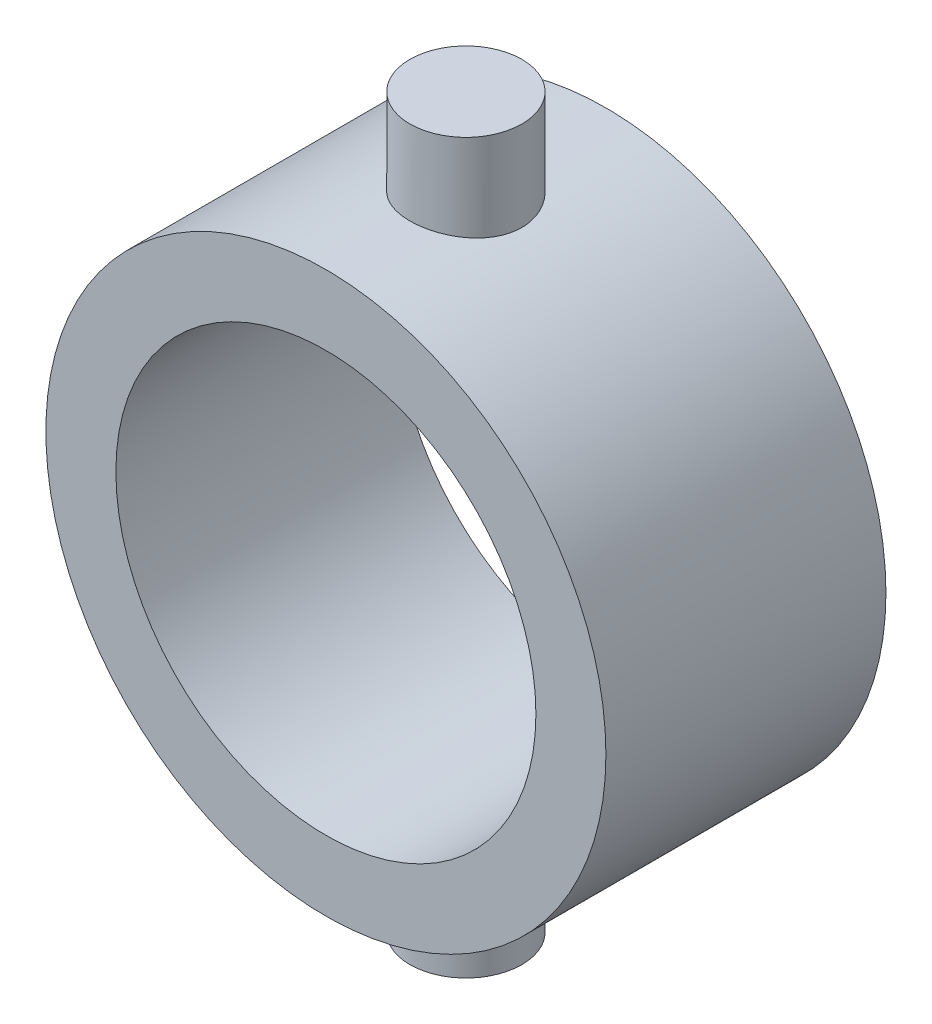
ISO-10303-21;
HEADER;
FILE_DESCRIPTION(('STEP AP214'),'2;1');
FILE_NAME('part.step','',(''),(''),'','','');
FILE_SCHEMA(('AUTOMOTIVE_DESIGN { 1 0 10303 214 1 1 1 1 }'));
ENDSEC;
DATA;
#1=APPLICATION_CONTEXT('core data for automotive mechanical design processes');
#2=APPLICATION_PROTOCOL_DEFINITION('international standard','automotive_design',2000,#1);
#3=PRODUCT_CONTEXT('',#1,'mechanical');
#4=PRODUCT('Part','Part','',(#3));
#5=PRODUCT_RELATED_PRODUCT_CATEGORY('part','',(#4));
#6=PRODUCT_DEFINITION_FORMATION('','',#4);
#7=PRODUCT_DEFINITION_CONTEXT('part definition',#1,'design');
#8=PRODUCT_DEFINITION('design','',#6,#7);
#9=PRODUCT_DEFINITION_SHAPE('','',#8);
#10=(LENGTH_UNIT() NAMED_UNIT(*) SI_UNIT(.MILLI.,.METRE.));
#11=(NAMED_UNIT(*) PLANE_ANGLE_UNIT() SI_UNIT($,.RADIAN.));
#12=(NAMED_UNIT(*) SI_UNIT($,.STERADIAN.) SOLID_ANGLE_UNIT());
#13=UNCERTAINTY_MEASURE_WITH_UNIT(LENGTH_MEASURE(1.E-05),#10,'distance_accuracy_value','');
#14=(GEOMETRIC_REPRESENTATION_CONTEXT(3) GLOBAL_UNCERTAINTY_ASSIGNED_CONTEXT((#13)) GLOBAL_UNIT_ASSIGNED_CONTEXT((#10,
#11,#12)) REPRESENTATION_CONTEXT('',''));
#15=CARTESIAN_POINT('',(0.,0.,0.));
#16=DIRECTION('',(0.,0.,1.));
#17=DIRECTION('',(1.,0.,0.));
#18=AXIS2_PLACEMENT_3D('',#15,#16,#17);
#19=CARTESIAN_POINT('',(0.,0.,10.));
#20=DIRECTION('',(0.,0.,-1.));
#21=DIRECTION('',(-1.,0.,0.));
#22=AXIS2_PLACEMENT_3D('',#19,#20,#21);
#23=CYLINDRICAL_SURFACE('',#22,10.);
#24=CARTESIAN_POINT('',(0.,0.,10.));
#25=DIRECTION('',(0.,0.,1.));
#26=DIRECTION('',(1.,0.,0.));
#27=AXIS2_PLACEMENT_3D('',#24,#25,#26);
#28=CIRCLE('',#27,10.);
#29=CARTESIAN_POINT('',(10.,0.,10.));
#30=VERTEX_POINT('',#29);
#31=EDGE_CURVE('E48',#30,#30,#28,.T.);
#32=ORIENTED_EDGE('',*,*,#31,.F.);
#33=EDGE_LOOP('',(#32));
#34=FACE_BOUND('',#33,.T.);
#35=CARTESIAN_POINT('',(0.,0.,0.));
#36=DIRECTION('',(0.,0.,1.));
#37=DIRECTION('',(1.,0.,0.));
#38=AXIS2_PLACEMENT_3D('',#35,#36,#37);
#39=CIRCLE('',#38,10.);
#40=CARTESIAN_POINT('',(10.,0.,0.));
#41=VERTEX_POINT('',#40);
#42=EDGE_CURVE('E98',#41,#41,#39,.T.);
#43=ORIENTED_EDGE('',*,*,#42,.T.);
#44=EDGE_LOOP('',(#43));
#45=FACE_BOUND('',#44,.T.);
#46=CARTESIAN_POINT('',(0.,-10.,3.));
#47=CARTESIAN_POINT('',(0.111153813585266,-9.99999795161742,3.00000408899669));
#48=CARTESIAN_POINT('',(0.222359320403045,-9.99812770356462,3.00929768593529));
#49=CARTESIAN_POINT('',(0.441627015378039,-9.99084731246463,3.04619700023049));
#50=CARTESIAN_POINT('',(0.549686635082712,-9.98543435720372,3.07381726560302));
#51=CARTESIAN_POINT('',(0.759460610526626,-9.97167298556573,3.14648254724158));
#52=CARTESIAN_POINT('',(0.861180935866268,-9.96332738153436,3.19151087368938));
#53=CARTESIAN_POINT('',(1.05561597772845,-9.94460796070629,3.29766449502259));
#54=CARTESIAN_POINT('',(1.14833123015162,-9.93423426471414,3.35878883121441));
#55=CARTESIAN_POINT('',(1.32338695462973,-9.9124433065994,3.49627698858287));
#56=CARTESIAN_POINT('',(1.40558790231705,-9.90101491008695,3.57281671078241));
#57=CARTESIAN_POINT('',(1.55607351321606,-9.87848360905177,3.73858483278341));
#58=CARTESIAN_POINT('',(1.62435708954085,-9.86738073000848,3.82781422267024));
#59=CARTESIAN_POINT('',(1.74566350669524,-9.8466488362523,4.01743238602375));
#60=CARTESIAN_POINT('',(1.79854187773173,-9.83703414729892,4.11791528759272));
#61=CARTESIAN_POINT('',(1.88661133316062,-9.82052536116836,4.32656363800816));
#62=CARTESIAN_POINT('',(1.92180416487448,-9.81363099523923,4.43472832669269));
#63=CARTESIAN_POINT('',(1.97305059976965,-9.80345610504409,4.65416872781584));
#64=CARTESIAN_POINT('',(1.98934899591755,-9.80012940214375,4.76538508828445));
#65=CARTESIAN_POINT('',(2.00310425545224,-9.79732750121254,4.98901964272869));
#66=CARTESIAN_POINT('',(2.000563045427,-9.79785190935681,5.10143771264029));
#67=CARTESIAN_POINT('',(1.97690914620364,-9.80265102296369,5.32249357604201));
#68=CARTESIAN_POINT('',(1.95607708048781,-9.80686905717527,5.43116281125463));
#69=CARTESIAN_POINT('',(1.8968757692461,-9.81849092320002,5.643432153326));
#70=CARTESIAN_POINT('',(1.85850568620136,-9.82589490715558,5.74703201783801));
#71=CARTESIAN_POINT('',(1.76504956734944,-9.84311237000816,5.9470305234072));
#72=CARTESIAN_POINT('',(1.70985230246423,-9.85294179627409,6.04337575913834));
#73=CARTESIAN_POINT('',(1.58438714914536,-9.87389237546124,6.22554169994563));
#74=CARTESIAN_POINT('',(1.51411752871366,-9.88501367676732,6.31136119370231));
#75=CARTESIAN_POINT('',(1.35899986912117,-9.90754042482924,6.47165880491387));
#76=CARTESIAN_POINT('',(1.27391232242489,-9.9189473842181,6.54590513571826));
#77=CARTESIAN_POINT('',(1.09237004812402,-9.94057697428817,6.67910769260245));
#78=CARTESIAN_POINT('',(0.995915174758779,-9.95079958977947,6.73806372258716));
#79=CARTESIAN_POINT('',(0.794118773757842,-9.96893380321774,6.83905501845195));
#80=CARTESIAN_POINT('',(0.688763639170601,-9.97684177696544,6.88106378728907));
#81=CARTESIAN_POINT('',(0.47229795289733,-9.98942817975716,6.94672094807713));
#82=CARTESIAN_POINT('',(0.361188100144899,-9.99410700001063,6.97037156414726));
#83=CARTESIAN_POINT('',(0.138358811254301,-9.99965343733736,6.99831290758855));
#84=CARTESIAN_POINT('',(0.0266806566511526,-10.0005834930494,7.00292083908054));
#85=CARTESIAN_POINT('',(-0.195849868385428,-9.99870103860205,6.99350028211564));
#86=CARTESIAN_POINT('',(-0.306702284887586,-9.99588873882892,6.97947284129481));
#87=CARTESIAN_POINT('',(-0.523411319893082,-9.98687664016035,6.93344325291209));
#88=CARTESIAN_POINT('',(-0.629303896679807,-9.98070752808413,6.90160386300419));
#89=CARTESIAN_POINT('',(-0.834247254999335,-9.96567104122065,6.82103203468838));
#90=CARTESIAN_POINT('',(-0.933297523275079,-9.95680346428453,6.77229833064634));
#91=CARTESIAN_POINT('',(-1.12308234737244,-9.93719823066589,6.65863501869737));
#92=CARTESIAN_POINT('',(-1.21370025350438,-9.92643900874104,6.59351443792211));
#93=CARTESIAN_POINT('',(-1.38283603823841,-9.90429469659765,6.44918161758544));
#94=CARTESIAN_POINT('',(-1.46135261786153,-9.89290953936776,6.36996786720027));
#95=CARTESIAN_POINT('',(-1.60528118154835,-9.8705860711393,6.19825329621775));
#96=CARTESIAN_POINT('',(-1.67047540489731,-9.85965720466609,6.10556851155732));
#97=CARTESIAN_POINT('',(-1.78437084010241,-9.83968383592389,5.91037727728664));
#98=CARTESIAN_POINT('',(-1.83307271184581,-9.83063925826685,5.80787122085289));
#99=CARTESIAN_POINT('',(-1.91230368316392,-9.81553481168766,5.5964635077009));
#100=CARTESIAN_POINT('',(-1.9429269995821,-9.80945949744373,5.48759831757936));
#101=CARTESIAN_POINT('',(-1.98541730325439,-9.8009487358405,5.26613309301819));
#102=CARTESIAN_POINT('',(-1.99728673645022,-9.79851281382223,5.15353354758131));
#103=CARTESIAN_POINT('',(-2.00184182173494,-9.79758299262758,4.92998227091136));
#104=CARTESIAN_POINT('',(-1.99487157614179,-9.79901838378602,4.81903770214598));
#105=CARTESIAN_POINT('',(-1.96270460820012,-9.80551146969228,4.59993670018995));
#106=CARTESIAN_POINT('',(-1.9375080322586,-9.81056913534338,4.49178024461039));
#107=CARTESIAN_POINT('',(-1.86975713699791,-9.82370528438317,4.28154457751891));
#108=CARTESIAN_POINT('',(-1.82724501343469,-9.83177642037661,4.17945127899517));
#109=CARTESIAN_POINT('',(-1.72610928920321,-9.85003429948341,3.98379255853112));
#110=CARTESIAN_POINT('',(-1.66748433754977,-9.86022121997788,3.89022785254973));
#111=CARTESIAN_POINT('',(-1.53461182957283,-9.88177921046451,3.71256885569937));
#112=CARTESIAN_POINT('',(-1.46011577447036,-9.89316745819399,3.62866246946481));
#113=CARTESIAN_POINT('',(-1.29812873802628,-9.91572163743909,3.47442758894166));
#114=CARTESIAN_POINT('',(-1.21063477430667,-9.92688751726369,3.40410221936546));
#115=CARTESIAN_POINT('',(-1.02403525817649,-9.94787664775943,3.27833071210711));
#116=CARTESIAN_POINT('',(-0.92481776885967,-9.95768462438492,3.22304799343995));
#117=CARTESIAN_POINT('',(-0.718332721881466,-9.9747025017,3.13002775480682));
#118=CARTESIAN_POINT('',(-0.611072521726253,-9.98191474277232,3.09227442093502));
#119=CARTESIAN_POINT('',(-0.419642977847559,-9.99152745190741,3.04269610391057));
#120=CARTESIAN_POINT('',(-0.336563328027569,-9.99468606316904,3.02671361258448));
#121=CARTESIAN_POINT('',(-0.168999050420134,-9.99892308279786,3.00536417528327));
#122=CARTESIAN_POINT('',(-0.0845144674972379,-10.0000015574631,2.99999689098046));
#123=CARTESIAN_POINT('',(0.,-10.,3.));
#124=B_SPLINE_CURVE_WITH_KNOTS('',3,(#46,#47,#48,#49,#50,#51,#52,#53,#54,#55,#56,#57,#58,#59,
#60,#61,#62,#63,#64,#65,#66,#67,#68,#69,#70,#71,#72,#73,#74,#75,#76,#77,#78,#79,#80,#81,#82,#83,
#84,#85,#86,#87,#88,#89,#90,#91,#92,#93,#94,#95,#96,#97,#98,#99,#100,#101,#102,#103,#104,#105,
#106,#107,#108,#109,#110,#111,#112,#113,#114,#115,#116,#117,#118,#119,#120,#121,#122,#123),
.UNSPECIFIED.,.T.,.F.,(4,2,2,2,2,2,2,2,2,2,2,2,2,2,2,2,2,2,2,2,2,2,2,2,2,2,2,2,2,2,2,2,2,2,2,2,
2,2,4),(0.,0.333152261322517,0.666569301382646,0.999667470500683,1.33274580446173,
1.66986534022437,2.00701119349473,2.34722390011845,2.68740298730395,3.02312370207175,
3.3588100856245,3.68943454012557,4.02007478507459,4.35294980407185,4.68586309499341,
5.02476504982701,5.3636713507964,5.70310549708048,6.04249851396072,6.3762147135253,
6.70991215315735,7.04060907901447,7.37133078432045,7.70610132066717,8.0409077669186,
8.38081257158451,8.72070377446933,9.05880762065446,9.39686736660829,9.72879445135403,
10.0607188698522,10.3918392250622,10.7229873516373,11.0597615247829,11.3966130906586,
11.7369899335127,12.0770591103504,12.3303755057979,12.5836838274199),.UNSPECIFIED.);
#125=CARTESIAN_POINT('',(0.,-10.,3.));
#126=VERTEX_POINT('',#125);
#127=EDGE_CURVE('E43',#126,#126,#124,.T.);
#128=ORIENTED_EDGE('',*,*,#127,.F.);
#129=EDGE_LOOP('',(#128));
#130=FACE_BOUND('',#129,.T.);
#131=CARTESIAN_POINT('',(0.,10.,3.));
#132=CARTESIAN_POINT('',(-0.111153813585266,9.99999795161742,3.00000408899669));
#133=CARTESIAN_POINT('',(-0.222359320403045,9.99812770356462,3.00929768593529));
#134=CARTESIAN_POINT('',(-0.441627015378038,9.99084731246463,3.04619700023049));
#135=CARTESIAN_POINT('',(-0.549686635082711,9.98543435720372,3.07381726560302));
#136=CARTESIAN_POINT('',(-0.759460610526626,9.97167298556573,3.14648254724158));
#137=CARTESIAN_POINT('',(-0.861180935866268,9.96332738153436,3.19151087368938));
#138=CARTESIAN_POINT('',(-1.05561597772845,9.94460796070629,3.29766449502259));
#139=CARTESIAN_POINT('',(-1.14833123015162,9.93423426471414,3.35878883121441));
#140=CARTESIAN_POINT('',(-1.32338695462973,9.9124433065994,3.49627698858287));
#141=CARTESIAN_POINT('',(-1.40558790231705,9.90101491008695,3.5728167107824));
#142=CARTESIAN_POINT('',(-1.55607351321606,9.87848360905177,3.7385848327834));
#143=CARTESIAN_POINT('',(-1.62435708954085,9.86738073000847,3.82781422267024));
#144=CARTESIAN_POINT('',(-1.74566350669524,9.8466488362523,4.01743238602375));
#145=CARTESIAN_POINT('',(-1.79854187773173,9.83703414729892,4.11791528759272));
#146=CARTESIAN_POINT('',(-1.88661133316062,9.82052536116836,4.32656363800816));
#147=CARTESIAN_POINT('',(-1.92180416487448,9.81363099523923,4.43472832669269));
#148=CARTESIAN_POINT('',(-1.97305059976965,9.80345610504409,4.65416872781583));
#149=CARTESIAN_POINT('',(-1.98934899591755,9.80012940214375,4.76538508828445));
#150=CARTESIAN_POINT('',(-2.00310425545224,9.79732750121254,4.98901964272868));
#151=CARTESIAN_POINT('',(-2.000563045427,9.79785190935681,5.10143771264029));
#152=CARTESIAN_POINT('',(-1.97690914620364,9.80265102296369,5.32249357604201));
#153=CARTESIAN_POINT('',(-1.95607708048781,9.80686905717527,5.43116281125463));
#154=CARTESIAN_POINT('',(-1.8968757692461,9.81849092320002,5.643432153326));
#155=CARTESIAN_POINT('',(-1.85850568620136,9.82589490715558,5.74703201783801));
#156=CARTESIAN_POINT('',(-1.76504956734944,9.84311237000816,5.9470305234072));
#157=CARTESIAN_POINT('',(-1.70985230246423,9.85294179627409,6.04337575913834));
#158=CARTESIAN_POINT('',(-1.58438714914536,9.87389237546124,6.22554169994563));
#159=CARTESIAN_POINT('',(-1.51411752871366,9.88501367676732,6.31136119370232));
#160=CARTESIAN_POINT('',(-1.35899986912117,9.90754042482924,6.47165880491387));
#161=CARTESIAN_POINT('',(-1.27391232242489,9.9189473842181,6.54590513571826));
#162=CARTESIAN_POINT('',(-1.09237004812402,9.94057697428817,6.67910769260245));
#163=CARTESIAN_POINT('',(-0.995915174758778,9.95079958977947,6.73806372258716));
#164=CARTESIAN_POINT('',(-0.794118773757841,9.96893380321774,6.83905501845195));
#165=CARTESIAN_POINT('',(-0.6887636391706,9.97684177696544,6.88106378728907));
#166=CARTESIAN_POINT('',(-0.472297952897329,9.98942817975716,6.94672094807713));
#167=CARTESIAN_POINT('',(-0.361188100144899,9.99410700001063,6.97037156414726));
#168=CARTESIAN_POINT('',(-0.1383588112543,9.99965343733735,6.99831290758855));
#169=CARTESIAN_POINT('',(-0.026680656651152,10.0005834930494,7.00292083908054));
#170=CARTESIAN_POINT('',(0.195849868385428,9.99870103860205,6.99350028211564));
#171=CARTESIAN_POINT('',(0.306702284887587,9.99588873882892,6.97947284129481));
#172=CARTESIAN_POINT('',(0.523411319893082,9.98687664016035,6.93344325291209));
#173=CARTESIAN_POINT('',(0.629303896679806,9.98070752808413,6.90160386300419));
#174=CARTESIAN_POINT('',(0.834247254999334,9.96567104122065,6.82103203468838));
#175=CARTESIAN_POINT('',(0.933297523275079,9.95680346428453,6.77229833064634));
#176=CARTESIAN_POINT('',(1.12308234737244,9.93719823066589,6.65863501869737));
#177=CARTESIAN_POINT('',(1.21370025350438,9.92643900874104,6.59351443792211));
#178=CARTESIAN_POINT('',(1.38283603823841,9.90429469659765,6.44918161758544));
#179=CARTESIAN_POINT('',(1.46135261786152,9.89290953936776,6.36996786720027));
#180=CARTESIAN_POINT('',(1.60528118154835,9.8705860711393,6.19825329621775));
#181=CARTESIAN_POINT('',(1.67047540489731,9.85965720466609,6.10556851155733));
#182=CARTESIAN_POINT('',(1.78437084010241,9.83968383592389,5.91037727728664));
#183=CARTESIAN_POINT('',(1.8330727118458,9.83063925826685,5.80787122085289));
#184=CARTESIAN_POINT('',(1.91230368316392,9.81553481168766,5.5964635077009));
#185=CARTESIAN_POINT('',(1.9429269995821,9.80945949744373,5.48759831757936));
#186=CARTESIAN_POINT('',(1.98541730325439,9.8009487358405,5.26613309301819));
#187=CARTESIAN_POINT('',(1.99728673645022,9.79851281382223,5.15353354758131));
#188=CARTESIAN_POINT('',(2.00184182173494,9.79758299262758,4.92998227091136));
#189=CARTESIAN_POINT('',(1.99487157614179,9.79901838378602,4.81903770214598));
#190=CARTESIAN_POINT('',(1.96270460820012,9.80551146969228,4.59993670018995));
#191=CARTESIAN_POINT('',(1.9375080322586,9.81056913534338,4.49178024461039));
#192=CARTESIAN_POINT('',(1.86975713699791,9.82370528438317,4.28154457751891));
#193=CARTESIAN_POINT('',(1.82724501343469,9.83177642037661,4.17945127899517));
#194=CARTESIAN_POINT('',(1.72610928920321,9.85003429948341,3.98379255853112));
#195=CARTESIAN_POINT('',(1.66748433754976,9.86022121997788,3.89022785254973));
#196=CARTESIAN_POINT('',(1.53461182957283,9.88177921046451,3.71256885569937));
#197=CARTESIAN_POINT('',(1.46011577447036,9.89316745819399,3.62866246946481));
#198=CARTESIAN_POINT('',(1.29812873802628,9.91572163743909,3.47442758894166));
#199=CARTESIAN_POINT('',(1.21063477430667,9.92688751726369,3.40410221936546));
#200=CARTESIAN_POINT('',(1.02403525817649,9.94787664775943,3.27833071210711));
#201=CARTESIAN_POINT('',(0.924817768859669,9.95768462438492,3.22304799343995));
#202=CARTESIAN_POINT('',(0.718332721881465,9.9747025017,3.13002775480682));
#203=CARTESIAN_POINT('',(0.611072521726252,9.98191474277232,3.09227442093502));
#204=CARTESIAN_POINT('',(0.419642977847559,9.99152745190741,3.04269610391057));
#205=CARTESIAN_POINT('',(0.336563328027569,9.99468606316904,3.02671361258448));
#206=CARTESIAN_POINT('',(0.168999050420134,9.99892308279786,3.00536417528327));
#207=CARTESIAN_POINT('',(0.0845144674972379,10.0000015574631,2.99999689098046));
#208=CARTESIAN_POINT('',(0.,10.,3.));
#209=B_SPLINE_CURVE_WITH_KNOTS('',3,(#131,#132,#133,#134,#135,#136,#137,#138,#139,#140,#141,
#142,#143,#144,#145,#146,#147,#148,#149,#150,#151,#152,#153,#154,#155,#156,#157,#158,#159,#160,
#161,#162,#163,#164,#165,#166,#167,#168,#169,#170,#171,#172,#173,#174,#175,#176,#177,#178,#179,
#180,#181,#182,#183,#184,#185,#186,#187,#188,#189,#190,#191,#192,#193,#194,#195,#196,#197,#198,
#199,#200,#201,#202,#203,#204,#205,#206,#207,#208),.UNSPECIFIED.,.T.,.F.,(4,2,2,2,2,2,2,2,2,2,2,
2,2,2,2,2,2,2,2,2,2,2,2,2,2,2,2,2,2,2,2,2,2,2,2,2,2,2,4),(0.,0.333152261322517,
0.666569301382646,0.999667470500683,1.33274580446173,1.66986534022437,2.00701119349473,
2.34722390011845,2.68740298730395,3.02312370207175,3.3588100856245,3.68943454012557,
4.02007478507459,4.35294980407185,4.68586309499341,5.02476504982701,5.3636713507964,
5.70310549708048,6.04249851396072,6.3762147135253,6.70991215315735,7.04060907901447,
7.37133078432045,7.70610132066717,8.0409077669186,8.38081257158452,8.72070377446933,
9.05880762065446,9.39686736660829,9.72879445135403,10.0607188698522,10.3918392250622,
10.7229873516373,11.0597615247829,11.3966130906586,11.7369899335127,12.0770591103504,
12.3303755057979,12.5836838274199),.UNSPECIFIED.);
#210=CARTESIAN_POINT('',(0.,10.,3.));
#211=VERTEX_POINT('',#210);
#212=EDGE_CURVE('E10',#211,#211,#209,.T.);
#213=ORIENTED_EDGE('',*,*,#212,.F.);
#214=EDGE_LOOP('',(#213));
#215=FACE_BOUND('',#214,.T.);
#216=ADVANCED_FACE('F35',(#34,#45,#130,#215),#23,.T.);
#217=CARTESIAN_POINT('',(0.,0.,-10.));
#218=DIRECTION('',(0.,0.,1.));
#219=DIRECTION('',(1.,0.,0.));
#220=AXIS2_PLACEMENT_3D('',#217,#218,#219);
#221=CYLINDRICAL_SURFACE('',#220,7.5);
#222=CARTESIAN_POINT('',(0.,0.,10.));
#223=DIRECTION('',(0.,0.,1.));
#224=DIRECTION('',(1.,0.,0.));
#225=AXIS2_PLACEMENT_3D('',#222,#223,#224);
#226=CIRCLE('',#225,7.5);
#227=CARTESIAN_POINT('',(7.5,0.,10.));
#228=VERTEX_POINT('',#227);
#229=EDGE_CURVE('E59',#228,#228,#226,.T.);
#230=ORIENTED_EDGE('',*,*,#229,.T.);
#231=EDGE_LOOP('',(#230));
#232=FACE_BOUND('',#231,.T.);
#233=CARTESIAN_POINT('',(0.,0.,0.));
#234=DIRECTION('',(0.,0.,1.));
#235=DIRECTION('',(1.,0.,0.));
#236=AXIS2_PLACEMENT_3D('',#233,#234,#235);
#237=CIRCLE('',#236,7.5);
#238=CARTESIAN_POINT('',(7.5,0.,0.));
#239=VERTEX_POINT('',#238);
#240=EDGE_CURVE('E39',#239,#239,#237,.T.);
#241=ORIENTED_EDGE('',*,*,#240,.F.);
#242=EDGE_LOOP('',(#241));
#243=FACE_BOUND('',#242,.T.);
#244=ADVANCED_FACE('F71',(#232,#243),#221,.F.);
#245=CARTESIAN_POINT('',(0.,0.,10.));
#246=DIRECTION('',(0.,0.,1.));
#247=DIRECTION('',(1.,0.,0.));
#248=AXIS2_PLACEMENT_3D('',#245,#246,#247);
#249=PLANE('',#248);
#250=ORIENTED_EDGE('',*,*,#229,.F.);
#251=EDGE_LOOP('',(#250));
#252=FACE_BOUND('',#251,.T.);
#253=ORIENTED_EDGE('',*,*,#31,.T.);
#254=EDGE_LOOP('',(#253));
#255=FACE_BOUND('',#254,.T.);
#256=ADVANCED_FACE('F75',(#252,#255),#249,.T.);
#257=CARTESIAN_POINT('',(0.,0.,0.));
#258=DIRECTION('',(0.,0.,1.));
#259=DIRECTION('',(1.,0.,0.));
#260=AXIS2_PLACEMENT_3D('',#257,#258,#259);
#261=PLANE('',#260);
#262=ORIENTED_EDGE('',*,*,#240,.T.);
#263=EDGE_LOOP('',(#262));
#264=FACE_BOUND('',#263,.T.);
#265=ORIENTED_EDGE('',*,*,#42,.F.);
#266=EDGE_LOOP('',(#265));
#267=FACE_BOUND('',#266,.T.);
#268=ADVANCED_FACE('F78',(#264,#267),#261,.F.);
#269=CARTESIAN_POINT('',(0.,-13.,5.));
#270=DIRECTION('',(0.,1.,0.));
#271=DIRECTION('',(0.,0.,1.));
#272=AXIS2_PLACEMENT_3D('',#269,#270,#271);
#273=PLANE('',#272);
#274=CARTESIAN_POINT('',(0.,-13.,5.));
#275=DIRECTION('',(0.,1.,0.));
#276=DIRECTION('',(0.,0.,1.));
#277=AXIS2_PLACEMENT_3D('',#274,#275,#276);
#278=CIRCLE('',#277,2.);
#279=CARTESIAN_POINT('',(0.,-13.,7.));
#280=VERTEX_POINT('',#279);
#281=EDGE_CURVE('E108',#280,#280,#278,.T.);
#282=ORIENTED_EDGE('',*,*,#281,.F.);
#283=EDGE_LOOP('',(#282));
#284=FACE_BOUND('',#283,.T.);
#285=ADVANCED_FACE('F69',(#284),#273,.F.);
#286=CARTESIAN_POINT('',(0.,13.,5.));
#287=DIRECTION('',(0.,-1.,0.));
#288=DIRECTION('',(0.,0.,-1.));
#289=AXIS2_PLACEMENT_3D('',#286,#287,#288);
#290=CYLINDRICAL_SURFACE('',#289,2.);
#291=ORIENTED_EDGE('',*,*,#281,.T.);
#292=EDGE_LOOP('',(#291));
#293=FACE_BOUND('',#292,.T.);
#294=ORIENTED_EDGE('',*,*,#127,.T.);
#295=EDGE_LOOP('',(#294));
#296=FACE_BOUND('',#295,.T.);
#297=ADVANCED_FACE('F67',(#293,#296),#290,.T.);
#298=CARTESIAN_POINT('',(0.,13.,5.));
#299=DIRECTION('',(0.,1.,0.));
#300=DIRECTION('',(0.,0.,1.));
#301=AXIS2_PLACEMENT_3D('',#298,#299,#300);
#302=CIRCLE('',#301,2.);
#303=CARTESIAN_POINT('',(0.,13.,7.));
#304=VERTEX_POINT('',#303);
#305=EDGE_CURVE('E109',#304,#304,#302,.T.);
#306=ORIENTED_EDGE('',*,*,#305,.F.);
#307=EDGE_LOOP('',(#306));
#308=FACE_BOUND('',#307,.T.);
#309=ORIENTED_EDGE('',*,*,#212,.T.);
#310=EDGE_LOOP('',(#309));
#311=FACE_BOUND('',#310,.T.);
#312=ADVANCED_FACE('F61',(#308,#311),#290,.T.);
#313=CARTESIAN_POINT('',(0.,13.,5.));
#314=DIRECTION('',(0.,1.,0.));
#315=DIRECTION('',(0.,0.,1.));
#316=AXIS2_PLACEMENT_3D('',#313,#314,#315);
#317=PLANE('',#316);
#318=ORIENTED_EDGE('',*,*,#305,.T.);
#319=EDGE_LOOP('',(#318));
#320=FACE_BOUND('',#319,.T.);
#321=ADVANCED_FACE('F66',(#320),#317,.T.);
#322=CLOSED_SHELL('',(#216,#244,#256,#268,#285,#297,#312,#321));
#323=MANIFOLD_SOLID_BREP('B2',#322);
#324=ADVANCED_BREP_SHAPE_REPRESENTATION('',(#18,#323),#14);
#325=SHAPE_DEFINITION_REPRESENTATION(#9,#324);
ENDSEC;
END-ISO-10303-21;
